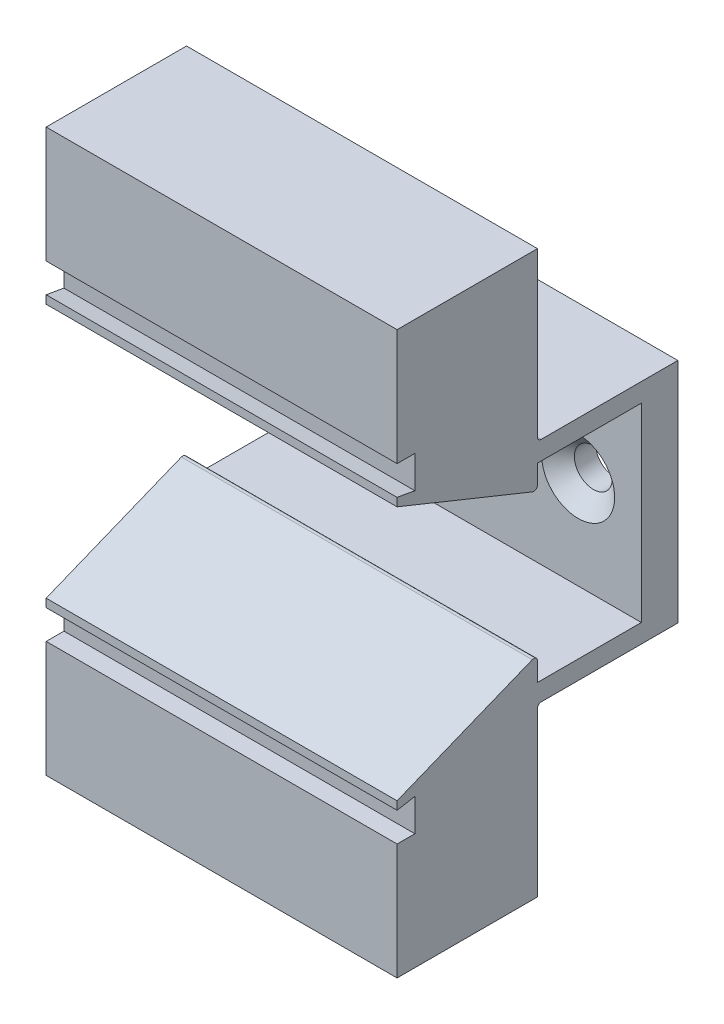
ISO-10303-21;
HEADER;
FILE_DESCRIPTION(('STEP AP214'),'2;1');
FILE_NAME('part.step','',(''),(''),'','','');
FILE_SCHEMA(('AUTOMOTIVE_DESIGN { 1 0 10303 214 1 1 1 1 }'));
ENDSEC;
DATA;
#1=APPLICATION_CONTEXT('core data for automotive mechanical design processes');
#2=APPLICATION_PROTOCOL_DEFINITION('international standard','automotive_design',2000,#1);
#3=PRODUCT_CONTEXT('',#1,'mechanical');
#4=PRODUCT('Part','Part','',(#3));
#5=PRODUCT_RELATED_PRODUCT_CATEGORY('part','',(#4));
#6=PRODUCT_DEFINITION_FORMATION('','',#4);
#7=PRODUCT_DEFINITION_CONTEXT('part definition',#1,'design');
#8=PRODUCT_DEFINITION('design','',#6,#7);
#9=PRODUCT_DEFINITION_SHAPE('','',#8);
#10=(LENGTH_UNIT() NAMED_UNIT(*) SI_UNIT(.MILLI.,.METRE.));
#11=(NAMED_UNIT(*) PLANE_ANGLE_UNIT() SI_UNIT($,.RADIAN.));
#12=(NAMED_UNIT(*) SI_UNIT($,.STERADIAN.) SOLID_ANGLE_UNIT());
#13=UNCERTAINTY_MEASURE_WITH_UNIT(LENGTH_MEASURE(1.E-05),#10,'distance_accuracy_value','');
#14=(GEOMETRIC_REPRESENTATION_CONTEXT(3) GLOBAL_UNCERTAINTY_ASSIGNED_CONTEXT((#13)) GLOBAL_UNIT_ASSIGNED_CONTEXT((#10,
#11,#12)) REPRESENTATION_CONTEXT('',''));
#15=CARTESIAN_POINT('',(0.,0.,0.));
#16=DIRECTION('',(0.,0.,1.));
#17=DIRECTION('',(1.,0.,0.));
#18=AXIS2_PLACEMENT_3D('',#15,#16,#17);
#19=CARTESIAN_POINT('',(23.8125,15.4305,0.));
#20=DIRECTION('',(0.,-1.,0.));
#21=DIRECTION('',(0.,0.,-1.));
#22=AXIS2_PLACEMENT_3D('',#19,#20,#21);
#23=PLANE('',#22);
#24=DIRECTION('',(0.,0.,1.));
#25=VECTOR('',#24,1.);
#26=CARTESIAN_POINT('',(-23.8125,15.4305,0.));
#27=LINE('',#26,#25);
#28=CARTESIAN_POINT('',(-23.8125,15.4305,0.));
#29=VERTEX_POINT('',#28);
#30=CARTESIAN_POINT('',(-23.8125,15.4305,18.542));
#31=VERTEX_POINT('',#30);
#32=EDGE_CURVE('E204',#29,#31,#27,.T.);
#33=ORIENTED_EDGE('',*,*,#32,.T.);
#34=DIRECTION('',(-1.,0.,0.));
#35=VECTOR('',#34,1.);
#36=CARTESIAN_POINT('',(23.8125,15.4305,18.542));
#37=LINE('',#36,#35);
#38=CARTESIAN_POINT('',(23.8125,15.4305,18.542));
#39=VERTEX_POINT('',#38);
#40=EDGE_CURVE('E9',#39,#31,#37,.T.);
#41=ORIENTED_EDGE('',*,*,#40,.F.);
#42=DIRECTION('',(0.,0.,1.));
#43=VECTOR('',#42,1.);
#44=CARTESIAN_POINT('',(23.8125,15.4305,0.));
#45=LINE('',#44,#43);
#46=CARTESIAN_POINT('',(23.8125,15.4305,0.));
#47=VERTEX_POINT('',#46);
#48=EDGE_CURVE('E276',#47,#39,#45,.T.);
#49=ORIENTED_EDGE('',*,*,#48,.F.);
#50=DIRECTION('',(-1.,0.,0.));
#51=VECTOR('',#50,1.);
#52=CARTESIAN_POINT('',(23.8125,15.4305,0.));
#53=LINE('',#52,#51);
#54=EDGE_CURVE('E217',#47,#29,#53,.T.);
#55=ORIENTED_EDGE('',*,*,#54,.T.);
#56=EDGE_LOOP('',(#33,#41,#49,#55));
#57=FACE_BOUND('',#56,.T.);
#58=ADVANCED_FACE('F14',(#57),#23,.F.);
#59=CARTESIAN_POINT('',(23.8125,15.9385,18.542));
#60=DIRECTION('',(-1.,0.,0.));
#61=DIRECTION('',(0.,-1.,0.));
#62=AXIS2_PLACEMENT_3D('',#59,#60,#61);
#63=CYLINDRICAL_SURFACE('',#62,0.508);
#64=CARTESIAN_POINT('',(-23.8125,15.9385,18.542));
#65=DIRECTION('',(-1.,0.,0.));
#66=DIRECTION('',(0.,-1.,0.));
#67=AXIS2_PLACEMENT_3D('',#64,#65,#66);
#68=CIRCLE('',#67,0.508);
#69=CARTESIAN_POINT('',(-23.8125,15.9385,19.05));
#70=VERTEX_POINT('',#69);
#71=EDGE_CURVE('E200',#31,#70,#68,.T.);
#72=ORIENTED_EDGE('',*,*,#71,.T.);
#73=DIRECTION('',(-1.,0.,0.));
#74=VECTOR('',#73,1.);
#75=CARTESIAN_POINT('',(23.8125,15.9385,19.05));
#76=LINE('',#75,#74);
#77=CARTESIAN_POINT('',(23.8125,15.9385,19.05));
#78=VERTEX_POINT('',#77);
#79=EDGE_CURVE('E22',#78,#70,#76,.T.);
#80=ORIENTED_EDGE('',*,*,#79,.F.);
#81=CARTESIAN_POINT('',(23.8125,15.9385,18.542));
#82=DIRECTION('',(-1.,0.,0.));
#83=DIRECTION('',(0.,-1.,0.));
#84=AXIS2_PLACEMENT_3D('',#81,#82,#83);
#85=CIRCLE('',#84,0.508);
#86=EDGE_CURVE('E213',#39,#78,#85,.T.);
#87=ORIENTED_EDGE('',*,*,#86,.F.);
#88=ORIENTED_EDGE('',*,*,#40,.T.);
#89=EDGE_LOOP('',(#72,#80,#87,#88));
#90=FACE_BOUND('',#89,.T.);
#91=ADVANCED_FACE('F212',(#90),#63,.F.);
#92=CARTESIAN_POINT('',(23.8125,15.9385,19.05));
#93=DIRECTION('',(0.,0.,1.));
#94=DIRECTION('',(1.,0.,0.));
#95=AXIS2_PLACEMENT_3D('',#92,#93,#94);
#96=PLANE('',#95);
#97=DIRECTION('',(0.,1.,0.));
#98=VECTOR('',#97,1.);
#99=CARTESIAN_POINT('',(-23.8125,15.9385,19.05));
#100=LINE('',#99,#98);
#101=CARTESIAN_POINT('',(-23.8125,38.1,19.05));
#102=VERTEX_POINT('',#101);
#103=EDGE_CURVE('E206',#70,#102,#100,.T.);
#104=ORIENTED_EDGE('',*,*,#103,.T.);
#105=DIRECTION('',(-1.,0.,0.));
#106=VECTOR('',#105,1.);
#107=CARTESIAN_POINT('',(23.8125,38.1,19.05));
#108=LINE('',#107,#106);
#109=CARTESIAN_POINT('',(23.8125,38.1,19.05));
#110=VERTEX_POINT('',#109);
#111=EDGE_CURVE('E402',#110,#102,#108,.T.);
#112=ORIENTED_EDGE('',*,*,#111,.F.);
#113=DIRECTION('',(0.,1.,0.));
#114=VECTOR('',#113,1.);
#115=CARTESIAN_POINT('',(23.8125,15.9385,19.05));
#116=LINE('',#115,#114);
#117=EDGE_CURVE('E279',#78,#110,#116,.T.);
#118=ORIENTED_EDGE('',*,*,#117,.F.);
#119=ORIENTED_EDGE('',*,*,#79,.T.);
#120=EDGE_LOOP('',(#104,#112,#118,#119));
#121=FACE_BOUND('',#120,.T.);
#122=ADVANCED_FACE('F569',(#121),#96,.F.);
#123=CARTESIAN_POINT('',(23.8125,38.1,19.05));
#124=DIRECTION('',(0.,-1.,0.));
#125=DIRECTION('',(1.,0.,0.));
#126=AXIS2_PLACEMENT_3D('',#123,#124,#125);
#127=PLANE('',#126);
#128=DIRECTION('',(0.,0.,1.));
#129=VECTOR('',#128,1.);
#130=CARTESIAN_POINT('',(-23.8125,38.1,19.05));
#131=LINE('',#130,#129);
#132=CARTESIAN_POINT('',(-23.8125,38.1,38.1));
#133=VERTEX_POINT('',#132);
#134=EDGE_CURVE('E226',#102,#133,#131,.T.);
#135=ORIENTED_EDGE('',*,*,#134,.T.);
#136=DIRECTION('',(-1.,0.,0.));
#137=VECTOR('',#136,1.);
#138=CARTESIAN_POINT('',(23.8125,38.1,38.1));
#139=LINE('',#138,#137);
#140=CARTESIAN_POINT('',(23.8125,38.1,38.1));
#141=VERTEX_POINT('',#140);
#142=EDGE_CURVE('E399',#141,#133,#139,.T.);
#143=ORIENTED_EDGE('',*,*,#142,.F.);
#144=DIRECTION('',(0.,0.,1.));
#145=VECTOR('',#144,1.);
#146=CARTESIAN_POINT('',(23.8125,38.1,19.05));
#147=LINE('',#146,#145);
#148=EDGE_CURVE('E281',#110,#141,#147,.T.);
#149=ORIENTED_EDGE('',*,*,#148,.F.);
#150=ORIENTED_EDGE('',*,*,#111,.T.);
#151=EDGE_LOOP('',(#135,#143,#149,#150));
#152=FACE_BOUND('',#151,.T.);
#153=ADVANCED_FACE('F565',(#152),#127,.F.);
#154=CARTESIAN_POINT('',(23.8125,38.1,38.1));
#155=DIRECTION('',(0.,0.,-1.));
#156=DIRECTION('',(0.,1.,0.));
#157=AXIS2_PLACEMENT_3D('',#154,#155,#156);
#158=PLANE('',#157);
#159=DIRECTION('',(0.,-1.,0.));
#160=VECTOR('',#159,1.);
#161=CARTESIAN_POINT('',(-23.8125,38.1,38.1));
#162=LINE('',#161,#160);
#163=CARTESIAN_POINT('',(-23.8125,22.352,38.1));
#164=VERTEX_POINT('',#163);
#165=EDGE_CURVE('E228',#133,#164,#162,.T.);
#166=ORIENTED_EDGE('',*,*,#165,.T.);
#167=DIRECTION('',(-1.,0.,0.));
#168=VECTOR('',#167,1.);
#169=CARTESIAN_POINT('',(23.8125,22.352,38.1));
#170=LINE('',#169,#168);
#171=CARTESIAN_POINT('',(23.8125,22.352,38.1));
#172=VERTEX_POINT('',#171);
#173=EDGE_CURVE('E396',#172,#164,#170,.T.);
#174=ORIENTED_EDGE('',*,*,#173,.F.);
#175=DIRECTION('',(0.,-1.,0.));
#176=VECTOR('',#175,1.);
#177=CARTESIAN_POINT('',(23.8125,38.1,38.1));
#178=LINE('',#177,#176);
#179=EDGE_CURVE('E283',#141,#172,#178,.T.);
#180=ORIENTED_EDGE('',*,*,#179,.F.);
#181=ORIENTED_EDGE('',*,*,#142,.T.);
#182=EDGE_LOOP('',(#166,#174,#180,#181));
#183=FACE_BOUND('',#182,.T.);
#184=ADVANCED_FACE('F561',(#183),#158,.F.);
#185=CARTESIAN_POINT('',(23.8125,22.352,38.1));
#186=DIRECTION('',(0.,1.,0.));
#187=DIRECTION('',(0.,0.,1.));
#188=AXIS2_PLACEMENT_3D('',#185,#186,#187);
#189=PLANE('',#188);
#190=DIRECTION('',(0.,0.,-1.));
#191=VECTOR('',#190,1.);
#192=CARTESIAN_POINT('',(-23.8125,22.352,38.1));
#193=LINE('',#192,#191);
#194=CARTESIAN_POINT('',(-23.8125,22.352,35.687));
#195=VERTEX_POINT('',#194);
#196=EDGE_CURVE('E230',#164,#195,#193,.T.);
#197=ORIENTED_EDGE('',*,*,#196,.T.);
#198=DIRECTION('',(-1.,0.,0.));
#199=VECTOR('',#198,1.);
#200=CARTESIAN_POINT('',(23.8125,22.352,35.687));
#201=LINE('',#200,#199);
#202=CARTESIAN_POINT('',(23.8125,22.352,35.687));
#203=VERTEX_POINT('',#202);
#204=EDGE_CURVE('E393',#203,#195,#201,.T.);
#205=ORIENTED_EDGE('',*,*,#204,.F.);
#206=DIRECTION('',(0.,0.,-1.));
#207=VECTOR('',#206,1.);
#208=CARTESIAN_POINT('',(23.8125,22.352,38.1));
#209=LINE('',#208,#207);
#210=EDGE_CURVE('E285',#172,#203,#209,.T.);
#211=ORIENTED_EDGE('',*,*,#210,.F.);
#212=ORIENTED_EDGE('',*,*,#173,.T.);
#213=EDGE_LOOP('',(#197,#205,#211,#212));
#214=FACE_BOUND('',#213,.T.);
#215=ADVANCED_FACE('F556',(#214),#189,.F.);
#216=CARTESIAN_POINT('',(23.8125,22.352,35.687));
#217=DIRECTION('',(0.,0.,-1.));
#218=DIRECTION('',(0.,1.,0.));
#219=AXIS2_PLACEMENT_3D('',#216,#217,#218);
#220=PLANE('',#219);
#221=DIRECTION('',(0.,-1.,0.));
#222=VECTOR('',#221,1.);
#223=CARTESIAN_POINT('',(-23.8125,22.352,35.687));
#224=LINE('',#223,#222);
#225=CARTESIAN_POINT('',(-23.8125,17.9641229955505,35.687));
#226=VERTEX_POINT('',#225);
#227=EDGE_CURVE('E232',#195,#226,#224,.T.);
#228=ORIENTED_EDGE('',*,*,#227,.T.);
#229=DIRECTION('',(-1.,0.,0.));
#230=VECTOR('',#229,1.);
#231=CARTESIAN_POINT('',(23.8125,17.9641229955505,35.687));
#232=LINE('',#231,#230);
#233=CARTESIAN_POINT('',(23.8125,17.9641229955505,35.687));
#234=VERTEX_POINT('',#233);
#235=EDGE_CURVE('E390',#234,#226,#232,.T.);
#236=ORIENTED_EDGE('',*,*,#235,.F.);
#237=DIRECTION('',(0.,-1.,0.));
#238=VECTOR('',#237,1.);
#239=CARTESIAN_POINT('',(23.8125,22.352,35.687));
#240=LINE('',#239,#238);
#241=EDGE_CURVE('E287',#203,#234,#240,.T.);
#242=ORIENTED_EDGE('',*,*,#241,.F.);
#243=ORIENTED_EDGE('',*,*,#204,.T.);
#244=EDGE_LOOP('',(#228,#236,#242,#243));
#245=FACE_BOUND('',#244,.T.);
#246=ADVANCED_FACE('F551',(#245),#220,.F.);
#247=CARTESIAN_POINT('',(23.8125,17.9641229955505,35.687));
#248=DIRECTION('',(0.,-0.984807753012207,0.173648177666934));
#249=DIRECTION('',(0.,-0.173648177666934,-0.984807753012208));
#250=AXIS2_PLACEMENT_3D('',#247,#248,#249);
#251=PLANE('',#250);
#252=DIRECTION('',(0.,0.173648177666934,0.984807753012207));
#253=VECTOR('',#252,1.);
#254=CARTESIAN_POINT('',(-23.8125,17.9641229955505,35.687));
#255=LINE('',#254,#253);
#256=CARTESIAN_POINT('',(-23.8125,18.3896,38.1));
#257=VERTEX_POINT('',#256);
#258=EDGE_CURVE('E234',#226,#257,#255,.T.);
#259=ORIENTED_EDGE('',*,*,#258,.T.);
#260=DIRECTION('',(-1.,0.,0.));
#261=VECTOR('',#260,1.);
#262=CARTESIAN_POINT('',(23.8125,18.3896,38.1));
#263=LINE('',#262,#261);
#264=CARTESIAN_POINT('',(23.8125,18.3896,38.1));
#265=VERTEX_POINT('',#264);
#266=EDGE_CURVE('E387',#265,#257,#263,.T.);
#267=ORIENTED_EDGE('',*,*,#266,.F.);
#268=DIRECTION('',(0.,0.173648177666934,0.984807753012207));
#269=VECTOR('',#268,1.);
#270=CARTESIAN_POINT('',(23.8125,17.9641229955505,35.687));
#271=LINE('',#270,#269);
#272=EDGE_CURVE('E289',#234,#265,#271,.T.);
#273=ORIENTED_EDGE('',*,*,#272,.F.);
#274=ORIENTED_EDGE('',*,*,#235,.T.);
#275=EDGE_LOOP('',(#259,#267,#273,#274));
#276=FACE_BOUND('',#275,.T.);
#277=ADVANCED_FACE('F547',(#276),#251,.F.);
#278=CARTESIAN_POINT('',(23.8125,18.3896,38.1));
#279=DIRECTION('',(0.,0.,-1.));
#280=DIRECTION('',(0.,1.,0.));
#281=AXIS2_PLACEMENT_3D('',#278,#279,#280);
#282=PLANE('',#281);
#283=DIRECTION('',(0.,-1.,0.));
#284=VECTOR('',#283,1.);
#285=CARTESIAN_POINT('',(-23.8125,18.3896,38.1));
#286=LINE('',#285,#284);
#287=CARTESIAN_POINT('',(-23.8125,17.272,38.1));
#288=VERTEX_POINT('',#287);
#289=EDGE_CURVE('E236',#257,#288,#286,.T.);
#290=ORIENTED_EDGE('',*,*,#289,.T.);
#291=DIRECTION('',(-1.,0.,0.));
#292=VECTOR('',#291,1.);
#293=CARTESIAN_POINT('',(23.8125,17.272,38.1));
#294=LINE('',#293,#292);
#295=CARTESIAN_POINT('',(23.8125,17.272,38.1));
#296=VERTEX_POINT('',#295);
#297=EDGE_CURVE('E384',#296,#288,#294,.T.);
#298=ORIENTED_EDGE('',*,*,#297,.F.);
#299=DIRECTION('',(0.,-1.,0.));
#300=VECTOR('',#299,1.);
#301=CARTESIAN_POINT('',(23.8125,18.3896,38.1));
#302=LINE('',#301,#300);
#303=EDGE_CURVE('E291',#265,#296,#302,.T.);
#304=ORIENTED_EDGE('',*,*,#303,.F.);
#305=ORIENTED_EDGE('',*,*,#266,.T.);
#306=EDGE_LOOP('',(#290,#298,#304,#305));
#307=FACE_BOUND('',#306,.T.);
#308=ADVANCED_FACE('F542',(#307),#282,.F.);
#309=CARTESIAN_POINT('',(23.8125,17.272,38.1));
#310=DIRECTION('',(0.,0.927183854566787,-0.374606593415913));
#311=DIRECTION('',(0.,0.374606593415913,0.927183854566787));
#312=AXIS2_PLACEMENT_3D('',#309,#310,#311);
#313=PLANE('',#312);
#314=DIRECTION('',(0.,-0.374606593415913,-0.927183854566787));
#315=VECTOR('',#314,1.);
#316=CARTESIAN_POINT('',(-23.8125,17.272,38.1));
#317=LINE('',#316,#315);
#318=CARTESIAN_POINT('',(-23.8125,9.85743197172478,19.7483001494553));
#319=VERTEX_POINT('',#318);
#320=EDGE_CURVE('E238',#288,#319,#317,.T.);
#321=ORIENTED_EDGE('',*,*,#320,.T.);
#322=DIRECTION('',(-1.,0.,0.));
#323=VECTOR('',#322,1.);
#324=CARTESIAN_POINT('',(23.8125,9.85743197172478,19.7483001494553));
#325=LINE('',#324,#323);
#326=CARTESIAN_POINT('',(23.8125,9.85743197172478,19.7483001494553));
#327=VERTEX_POINT('',#326);
#328=EDGE_CURVE('E381',#327,#319,#325,.T.);
#329=ORIENTED_EDGE('',*,*,#328,.F.);
#330=DIRECTION('',(0.,-0.374606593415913,-0.927183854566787));
#331=VECTOR('',#330,1.);
#332=CARTESIAN_POINT('',(23.8125,17.272,38.1));
#333=LINE('',#332,#331);
#334=EDGE_CURVE('E293',#296,#327,#333,.T.);
#335=ORIENTED_EDGE('',*,*,#334,.F.);
#336=ORIENTED_EDGE('',*,*,#297,.T.);
#337=EDGE_LOOP('',(#321,#329,#335,#336));
#338=FACE_BOUND('',#337,.T.);
#339=ADVANCED_FACE('F536',(#338),#313,.F.);
#340=CARTESIAN_POINT('',(23.8125,10.3284413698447,19.558));
#341=DIRECTION('',(-1.,0.,0.));
#342=DIRECTION('',(0.,-1.,0.));
#343=AXIS2_PLACEMENT_3D('',#340,#341,#342);
#344=CYLINDRICAL_SURFACE('',#343,0.508);
#345=CARTESIAN_POINT('',(-23.8125,10.3284413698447,19.558));
#346=DIRECTION('',(1.,0.,0.));
#347=DIRECTION('',(0.,1.,0.));
#348=AXIS2_PLACEMENT_3D('',#345,#346,#347);
#349=CIRCLE('',#348,0.508);
#350=CARTESIAN_POINT('',(-23.8125,10.3284413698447,19.05));
#351=VERTEX_POINT('',#350);
#352=EDGE_CURVE('E240',#319,#351,#349,.T.);
#353=ORIENTED_EDGE('',*,*,#352,.T.);
#354=DIRECTION('',(-1.,0.,0.));
#355=VECTOR('',#354,1.);
#356=CARTESIAN_POINT('',(23.8125,10.3284413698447,19.05));
#357=LINE('',#356,#355);
#358=CARTESIAN_POINT('',(23.8125,10.3284413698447,19.05));
#359=VERTEX_POINT('',#358);
#360=EDGE_CURVE('E378',#359,#351,#357,.T.);
#361=ORIENTED_EDGE('',*,*,#360,.F.);
#362=CARTESIAN_POINT('',(23.8125,10.3284413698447,19.558));
#363=DIRECTION('',(1.,0.,0.));
#364=DIRECTION('',(0.,1.,0.));
#365=AXIS2_PLACEMENT_3D('',#362,#363,#364);
#366=CIRCLE('',#365,0.508);
#367=EDGE_CURVE('E295',#327,#359,#366,.T.);
#368=ORIENTED_EDGE('',*,*,#367,.F.);
#369=ORIENTED_EDGE('',*,*,#328,.T.);
#370=EDGE_LOOP('',(#353,#361,#368,#369));
#371=FACE_BOUND('',#370,.T.);
#372=ADVANCED_FACE('F532',(#371),#344,.T.);
#373=CARTESIAN_POINT('',(23.8125,10.3284413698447,19.05));
#374=DIRECTION('',(0.,0.,1.));
#375=DIRECTION('',(1.,0.,0.));
#376=AXIS2_PLACEMENT_3D('',#373,#374,#375);
#377=PLANE('',#376);
#378=DIRECTION('',(0.,1.,0.));
#379=VECTOR('',#378,1.);
#380=CARTESIAN_POINT('',(-23.8125,10.3284413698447,19.05));
#381=LINE('',#380,#379);
#382=CARTESIAN_POINT('',(-23.8125,12.8905,19.05));
#383=VERTEX_POINT('',#382);
#384=EDGE_CURVE('E242',#351,#383,#381,.T.);
#385=ORIENTED_EDGE('',*,*,#384,.T.);
#386=DIRECTION('',(-1.,0.,0.));
#387=VECTOR('',#386,1.);
#388=CARTESIAN_POINT('',(23.8125,12.8905,19.05));
#389=LINE('',#388,#387);
#390=CARTESIAN_POINT('',(23.8125,12.8905,19.05));
#391=VERTEX_POINT('',#390);
#392=EDGE_CURVE('E375',#391,#383,#389,.T.);
#393=ORIENTED_EDGE('',*,*,#392,.F.);
#394=DIRECTION('',(0.,1.,0.));
#395=VECTOR('',#394,1.);
#396=CARTESIAN_POINT('',(23.8125,10.3284413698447,19.05));
#397=LINE('',#396,#395);
#398=EDGE_CURVE('E297',#359,#391,#397,.T.);
#399=ORIENTED_EDGE('',*,*,#398,.F.);
#400=ORIENTED_EDGE('',*,*,#360,.T.);
#401=EDGE_LOOP('',(#385,#393,#399,#400));
#402=FACE_BOUND('',#401,.T.);
#403=ADVANCED_FACE('F527',(#402),#377,.F.);
#404=CARTESIAN_POINT('',(23.8125,12.8905,19.05));
#405=DIRECTION('',(0.,1.,0.));
#406=DIRECTION('',(-1.,0.,0.));
#407=AXIS2_PLACEMENT_3D('',#404,#405,#406);
#408=PLANE('',#407);
#409=DIRECTION('',(0.,0.,-1.));
#410=VECTOR('',#409,1.);
#411=CARTESIAN_POINT('',(-23.8125,12.8905,19.05));
#412=LINE('',#411,#410);
#413=CARTESIAN_POINT('',(-23.8125,12.8905,4.953));
#414=VERTEX_POINT('',#413);
#415=EDGE_CURVE('E244',#383,#414,#412,.T.);
#416=ORIENTED_EDGE('',*,*,#415,.T.);
#417=DIRECTION('',(-1.,0.,0.));
#418=VECTOR('',#417,1.);
#419=CARTESIAN_POINT('',(23.8125,12.8905,4.953));
#420=LINE('',#419,#418);
#421=CARTESIAN_POINT('',(23.8125,12.8905,4.953));
#422=VERTEX_POINT('',#421);
#423=EDGE_CURVE('E372',#422,#414,#420,.T.);
#424=ORIENTED_EDGE('',*,*,#423,.F.);
#425=DIRECTION('',(0.,0.,-1.));
#426=VECTOR('',#425,1.);
#427=CARTESIAN_POINT('',(23.8125,12.8905,19.05));
#428=LINE('',#427,#426);
#429=EDGE_CURVE('E299',#391,#422,#428,.T.);
#430=ORIENTED_EDGE('',*,*,#429,.F.);
#431=ORIENTED_EDGE('',*,*,#392,.T.);
#432=EDGE_LOOP('',(#416,#424,#430,#431));
#433=FACE_BOUND('',#432,.T.);
#434=ADVANCED_FACE('F521',(#433),#408,.F.);
#435=CARTESIAN_POINT('',(23.8125,12.8905,4.953));
#436=DIRECTION('',(0.,0.,-1.));
#437=DIRECTION('',(-1.,0.,0.));
#438=AXIS2_PLACEMENT_3D('',#435,#436,#437);
#439=PLANE('',#438);
#440=CARTESIAN_POINT('',(-15.24,0.,4.953));
#441=DIRECTION('',(0.,0.,-1.));
#442=DIRECTION('',(0.,1.,0.));
#443=AXIS2_PLACEMENT_3D('',#440,#441,#442);
#444=CIRCLE('',#443,4.953);
#445=CARTESIAN_POINT('',(-15.24,4.953,4.953));
#446=VERTEX_POINT('',#445);
#447=EDGE_CURVE('E422',#446,#446,#444,.T.);
#448=ORIENTED_EDGE('',*,*,#447,.T.);
#449=EDGE_LOOP('',(#448));
#450=FACE_BOUND('',#449,.T.);
#451=CARTESIAN_POINT('',(15.24,0.,4.953));
#452=DIRECTION('',(0.,0.,-1.));
#453=DIRECTION('',(0.,1.,0.));
#454=AXIS2_PLACEMENT_3D('',#451,#452,#453);
#455=CIRCLE('',#454,4.953);
#456=CARTESIAN_POINT('',(15.24,4.953,4.953));
#457=VERTEX_POINT('',#456);
#458=EDGE_CURVE('E412',#457,#457,#455,.T.);
#459=ORIENTED_EDGE('',*,*,#458,.T.);
#460=EDGE_LOOP('',(#459));
#461=FACE_BOUND('',#460,.T.);
#462=CARTESIAN_POINT('',(0.,0.,4.953));
#463=DIRECTION('',(0.,0.,-1.));
#464=DIRECTION('',(-1.,0.,0.));
#465=AXIS2_PLACEMENT_3D('',#462,#463,#464);
#466=CIRCLE('',#465,6.7437);
#467=CARTESIAN_POINT('',(-6.7437,0.,4.953));
#468=VERTEX_POINT('',#467);
#469=EDGE_CURVE('E218',#468,#468,#466,.T.);
#470=ORIENTED_EDGE('',*,*,#469,.T.);
#471=EDGE_LOOP('',(#470));
#472=FACE_BOUND('',#471,.T.);
#473=DIRECTION('',(0.,-1.,0.));
#474=VECTOR('',#473,1.);
#475=CARTESIAN_POINT('',(-23.8125,12.8905,4.953));
#476=LINE('',#475,#474);
#477=CARTESIAN_POINT('',(-23.8125,-12.8905,4.953));
#478=VERTEX_POINT('',#477);
#479=EDGE_CURVE('E246',#414,#478,#476,.T.);
#480=ORIENTED_EDGE('',*,*,#479,.T.);
#481=DIRECTION('',(-1.,0.,0.));
#482=VECTOR('',#481,1.);
#483=CARTESIAN_POINT('',(23.8125,-12.8905,4.953));
#484=LINE('',#483,#482);
#485=CARTESIAN_POINT('',(23.8125,-12.8905,4.953));
#486=VERTEX_POINT('',#485);
#487=EDGE_CURVE('E369',#486,#478,#484,.T.);
#488=ORIENTED_EDGE('',*,*,#487,.F.);
#489=DIRECTION('',(0.,-1.,0.));
#490=VECTOR('',#489,1.);
#491=CARTESIAN_POINT('',(23.8125,12.8905,4.953));
#492=LINE('',#491,#490);
#493=EDGE_CURVE('E301',#422,#486,#492,.T.);
#494=ORIENTED_EDGE('',*,*,#493,.F.);
#495=ORIENTED_EDGE('',*,*,#423,.T.);
#496=EDGE_LOOP('',(#480,#488,#494,#495));
#497=FACE_BOUND('',#496,.T.);
#498=ADVANCED_FACE('F426',(#450,#461,#472,#497),#439,.F.);
#499=CARTESIAN_POINT('',(23.8125,-12.8905,19.05));
#500=DIRECTION('',(0.,-1.,0.));
#501=DIRECTION('',(0.,0.,-1.));
#502=AXIS2_PLACEMENT_3D('',#499,#500,#501);
#503=PLANE('',#502);
#504=DIRECTION('',(0.,0.,1.));
#505=VECTOR('',#504,1.);
#506=CARTESIAN_POINT('',(-23.8125,-12.8905,19.05));
#507=LINE('',#506,#505);
#508=CARTESIAN_POINT('',(-23.8125,-12.8905,19.05));
#509=VERTEX_POINT('',#508);
#510=EDGE_CURVE('E248',#478,#509,#507,.T.);
#511=ORIENTED_EDGE('',*,*,#510,.T.);
#512=DIRECTION('',(-1.,0.,0.));
#513=VECTOR('',#512,1.);
#514=CARTESIAN_POINT('',(23.8125,-12.8905,19.05));
#515=LINE('',#514,#513);
#516=CARTESIAN_POINT('',(23.8125,-12.8905,19.05));
#517=VERTEX_POINT('',#516);
#518=EDGE_CURVE('E366',#517,#509,#515,.T.);
#519=ORIENTED_EDGE('',*,*,#518,.F.);
#520=DIRECTION('',(0.,0.,1.));
#521=VECTOR('',#520,1.);
#522=CARTESIAN_POINT('',(23.8125,-12.8905,19.05));
#523=LINE('',#522,#521);
#524=EDGE_CURVE('E303',#486,#517,#523,.T.);
#525=ORIENTED_EDGE('',*,*,#524,.F.);
#526=ORIENTED_EDGE('',*,*,#487,.T.);
#527=EDGE_LOOP('',(#511,#519,#525,#526));
#528=FACE_BOUND('',#527,.T.);
#529=ADVANCED_FACE('F513',(#528),#503,.F.);
#530=CARTESIAN_POINT('',(23.8125,-10.3284413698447,19.05));
#531=DIRECTION('',(0.,0.,1.));
#532=DIRECTION('',(1.,0.,0.));
#533=AXIS2_PLACEMENT_3D('',#530,#531,#532);
#534=PLANE('',#533);
#535=DIRECTION('',(0.,1.,0.));
#536=VECTOR('',#535,1.);
#537=CARTESIAN_POINT('',(-23.8125,-10.3284413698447,19.05));
#538=LINE('',#537,#536);
#539=CARTESIAN_POINT('',(-23.8125,-10.3284413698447,19.05));
#540=VERTEX_POINT('',#539);
#541=EDGE_CURVE('E250',#509,#540,#538,.T.);
#542=ORIENTED_EDGE('',*,*,#541,.T.);
#543=DIRECTION('',(-1.,0.,0.));
#544=VECTOR('',#543,1.);
#545=CARTESIAN_POINT('',(23.8125,-10.3284413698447,19.05));
#546=LINE('',#545,#544);
#547=CARTESIAN_POINT('',(23.8125,-10.3284413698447,19.05));
#548=VERTEX_POINT('',#547);
#549=EDGE_CURVE('E363',#548,#540,#546,.T.);
#550=ORIENTED_EDGE('',*,*,#549,.F.);
#551=DIRECTION('',(0.,1.,0.));
#552=VECTOR('',#551,1.);
#553=CARTESIAN_POINT('',(23.8125,-10.3284413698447,19.05));
#554=LINE('',#553,#552);
#555=EDGE_CURVE('E305',#517,#548,#554,.T.);
#556=ORIENTED_EDGE('',*,*,#555,.F.);
#557=ORIENTED_EDGE('',*,*,#518,.T.);
#558=EDGE_LOOP('',(#542,#550,#556,#557));
#559=FACE_BOUND('',#558,.T.);
#560=ADVANCED_FACE('F507',(#559),#534,.F.);
#561=CARTESIAN_POINT('',(23.8125,-10.3284413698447,19.558));
#562=DIRECTION('',(-1.,0.,0.));
#563=DIRECTION('',(0.,-1.,0.));
#564=AXIS2_PLACEMENT_3D('',#561,#562,#563);
#565=CYLINDRICAL_SURFACE('',#564,0.508);
#566=CARTESIAN_POINT('',(-23.8125,-10.3284413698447,19.558));
#567=DIRECTION('',(1.,0.,0.));
#568=DIRECTION('',(0.,-1.,0.));
#569=AXIS2_PLACEMENT_3D('',#566,#567,#568);
#570=CIRCLE('',#569,0.508);
#571=CARTESIAN_POINT('',(-23.8125,-9.8574319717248,19.7483001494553));
#572=VERTEX_POINT('',#571);
#573=EDGE_CURVE('E252',#540,#572,#570,.T.);
#574=ORIENTED_EDGE('',*,*,#573,.T.);
#575=DIRECTION('',(-1.,0.,0.));
#576=VECTOR('',#575,1.);
#577=CARTESIAN_POINT('',(23.8125,-9.8574319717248,19.7483001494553));
#578=LINE('',#577,#576);
#579=CARTESIAN_POINT('',(23.8125,-9.8574319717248,19.7483001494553));
#580=VERTEX_POINT('',#579);
#581=EDGE_CURVE('E360',#580,#572,#578,.T.);
#582=ORIENTED_EDGE('',*,*,#581,.F.);
#583=CARTESIAN_POINT('',(23.8125,-10.3284413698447,19.558));
#584=DIRECTION('',(1.,0.,0.));
#585=DIRECTION('',(0.,-1.,0.));
#586=AXIS2_PLACEMENT_3D('',#583,#584,#585);
#587=CIRCLE('',#586,0.508);
#588=EDGE_CURVE('E307',#548,#580,#587,.T.);
#589=ORIENTED_EDGE('',*,*,#588,.F.);
#590=ORIENTED_EDGE('',*,*,#549,.T.);
#591=EDGE_LOOP('',(#574,#582,#589,#590));
#592=FACE_BOUND('',#591,.T.);
#593=ADVANCED_FACE('F503',(#592),#565,.T.);
#594=CARTESIAN_POINT('',(23.8125,-17.272,38.1));
#595=DIRECTION('',(0.,-0.927183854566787,-0.374606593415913));
#596=DIRECTION('',(0.,0.374606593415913,-0.927183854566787));
#597=AXIS2_PLACEMENT_3D('',#594,#595,#596);
#598=PLANE('',#597);
#599=DIRECTION('',(0.,-0.374606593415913,0.927183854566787));
#600=VECTOR('',#599,1.);
#601=CARTESIAN_POINT('',(-23.8125,-17.272,38.1));
#602=LINE('',#601,#600);
#603=CARTESIAN_POINT('',(-23.8125,-17.272,38.1));
#604=VERTEX_POINT('',#603);
#605=EDGE_CURVE('E254',#572,#604,#602,.T.);
#606=ORIENTED_EDGE('',*,*,#605,.T.);
#607=DIRECTION('',(-1.,0.,0.));
#608=VECTOR('',#607,1.);
#609=CARTESIAN_POINT('',(23.8125,-17.272,38.1));
#610=LINE('',#609,#608);
#611=CARTESIAN_POINT('',(23.8125,-17.272,38.1));
#612=VERTEX_POINT('',#611);
#613=EDGE_CURVE('E357',#612,#604,#610,.T.);
#614=ORIENTED_EDGE('',*,*,#613,.F.);
#615=DIRECTION('',(0.,-0.374606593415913,0.927183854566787));
#616=VECTOR('',#615,1.);
#617=CARTESIAN_POINT('',(23.8125,-17.272,38.1));
#618=LINE('',#617,#616);
#619=EDGE_CURVE('E309',#580,#612,#618,.T.);
#620=ORIENTED_EDGE('',*,*,#619,.F.);
#621=ORIENTED_EDGE('',*,*,#581,.T.);
#622=EDGE_LOOP('',(#606,#614,#620,#621));
#623=FACE_BOUND('',#622,.T.);
#624=ADVANCED_FACE('F498',(#623),#598,.F.);
#625=CARTESIAN_POINT('',(23.8125,-18.3896,38.1));
#626=DIRECTION('',(0.,0.,-1.));
#627=DIRECTION('',(0.,1.,0.));
#628=AXIS2_PLACEMENT_3D('',#625,#626,#627);
#629=PLANE('',#628);
#630=DIRECTION('',(0.,-1.,0.));
#631=VECTOR('',#630,1.);
#632=CARTESIAN_POINT('',(-23.8125,-18.3896,38.1));
#633=LINE('',#632,#631);
#634=CARTESIAN_POINT('',(-23.8125,-18.3896,38.1));
#635=VERTEX_POINT('',#634);
#636=EDGE_CURVE('E256',#604,#635,#633,.T.);
#637=ORIENTED_EDGE('',*,*,#636,.T.);
#638=DIRECTION('',(-1.,0.,0.));
#639=VECTOR('',#638,1.);
#640=CARTESIAN_POINT('',(23.8125,-18.3896,38.1));
#641=LINE('',#640,#639);
#642=CARTESIAN_POINT('',(23.8125,-18.3896,38.1));
#643=VERTEX_POINT('',#642);
#644=EDGE_CURVE('E354',#643,#635,#641,.T.);
#645=ORIENTED_EDGE('',*,*,#644,.F.);
#646=DIRECTION('',(0.,-1.,0.));
#647=VECTOR('',#646,1.);
#648=CARTESIAN_POINT('',(23.8125,-18.3896,38.1));
#649=LINE('',#648,#647);
#650=EDGE_CURVE('E311',#612,#643,#649,.T.);
#651=ORIENTED_EDGE('',*,*,#650,.F.);
#652=ORIENTED_EDGE('',*,*,#613,.T.);
#653=EDGE_LOOP('',(#637,#645,#651,#652));
#654=FACE_BOUND('',#653,.T.);
#655=ADVANCED_FACE('F492',(#654),#629,.F.);
#656=CARTESIAN_POINT('',(23.8125,-17.9641229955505,35.687));
#657=DIRECTION('',(0.,0.984807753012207,0.173648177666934));
#658=DIRECTION('',(0.,-0.173648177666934,0.984807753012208));
#659=AXIS2_PLACEMENT_3D('',#656,#657,#658);
#660=PLANE('',#659);
#661=DIRECTION('',(0.,0.173648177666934,-0.984807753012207));
#662=VECTOR('',#661,1.);
#663=CARTESIAN_POINT('',(-23.8125,-17.9641229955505,35.687));
#664=LINE('',#663,#662);
#665=CARTESIAN_POINT('',(-23.8125,-17.9641229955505,35.687));
#666=VERTEX_POINT('',#665);
#667=EDGE_CURVE('E258',#635,#666,#664,.T.);
#668=ORIENTED_EDGE('',*,*,#667,.T.);
#669=DIRECTION('',(-1.,0.,0.));
#670=VECTOR('',#669,1.);
#671=CARTESIAN_POINT('',(23.8125,-17.9641229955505,35.687));
#672=LINE('',#671,#670);
#673=CARTESIAN_POINT('',(23.8125,-17.9641229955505,35.687));
#674=VERTEX_POINT('',#673);
#675=EDGE_CURVE('E351',#674,#666,#672,.T.);
#676=ORIENTED_EDGE('',*,*,#675,.F.);
#677=DIRECTION('',(0.,0.173648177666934,-0.984807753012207));
#678=VECTOR('',#677,1.);
#679=CARTESIAN_POINT('',(23.8125,-17.9641229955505,35.687));
#680=LINE('',#679,#678);
#681=EDGE_CURVE('E313',#643,#674,#680,.T.);
#682=ORIENTED_EDGE('',*,*,#681,.F.);
#683=ORIENTED_EDGE('',*,*,#644,.T.);
#684=EDGE_LOOP('',(#668,#676,#682,#683));
#685=FACE_BOUND('',#684,.T.);
#686=ADVANCED_FACE('F488',(#685),#660,.F.);
#687=CARTESIAN_POINT('',(23.8125,-22.352,35.687));
#688=DIRECTION('',(0.,0.,-1.));
#689=DIRECTION('',(0.,1.,0.));
#690=AXIS2_PLACEMENT_3D('',#687,#688,#689);
#691=PLANE('',#690);
#692=DIRECTION('',(0.,-1.,0.));
#693=VECTOR('',#692,1.);
#694=CARTESIAN_POINT('',(-23.8125,-22.352,35.687));
#695=LINE('',#694,#693);
#696=CARTESIAN_POINT('',(-23.8125,-22.352,35.687));
#697=VERTEX_POINT('',#696);
#698=EDGE_CURVE('E260',#666,#697,#695,.T.);
#699=ORIENTED_EDGE('',*,*,#698,.T.);
#700=DIRECTION('',(-1.,0.,0.));
#701=VECTOR('',#700,1.);
#702=CARTESIAN_POINT('',(23.8125,-22.352,35.687));
#703=LINE('',#702,#701);
#704=CARTESIAN_POINT('',(23.8125,-22.352,35.687));
#705=VERTEX_POINT('',#704);
#706=EDGE_CURVE('E348',#705,#697,#703,.T.);
#707=ORIENTED_EDGE('',*,*,#706,.F.);
#708=DIRECTION('',(0.,-1.,0.));
#709=VECTOR('',#708,1.);
#710=CARTESIAN_POINT('',(23.8125,-22.352,35.687));
#711=LINE('',#710,#709);
#712=EDGE_CURVE('E315',#674,#705,#711,.T.);
#713=ORIENTED_EDGE('',*,*,#712,.F.);
#714=ORIENTED_EDGE('',*,*,#675,.T.);
#715=EDGE_LOOP('',(#699,#707,#713,#714));
#716=FACE_BOUND('',#715,.T.);
#717=ADVANCED_FACE('F483',(#716),#691,.F.);
#718=CARTESIAN_POINT('',(23.8125,-22.352,38.1));
#719=DIRECTION('',(0.,-1.,0.));
#720=DIRECTION('',(0.,0.,-1.));
#721=AXIS2_PLACEMENT_3D('',#718,#719,#720);
#722=PLANE('',#721);
#723=DIRECTION('',(0.,0.,1.));
#724=VECTOR('',#723,1.);
#725=CARTESIAN_POINT('',(-23.8125,-22.352,38.1));
#726=LINE('',#725,#724);
#727=CARTESIAN_POINT('',(-23.8125,-22.352,38.1));
#728=VERTEX_POINT('',#727);
#729=EDGE_CURVE('E262',#697,#728,#726,.T.);
#730=ORIENTED_EDGE('',*,*,#729,.T.);
#731=DIRECTION('',(-1.,0.,0.));
#732=VECTOR('',#731,1.);
#733=CARTESIAN_POINT('',(23.8125,-22.352,38.1));
#734=LINE('',#733,#732);
#735=CARTESIAN_POINT('',(23.8125,-22.352,38.1));
#736=VERTEX_POINT('',#735);
#737=EDGE_CURVE('E345',#736,#728,#734,.T.);
#738=ORIENTED_EDGE('',*,*,#737,.F.);
#739=DIRECTION('',(0.,0.,1.));
#740=VECTOR('',#739,1.);
#741=CARTESIAN_POINT('',(23.8125,-22.352,38.1));
#742=LINE('',#741,#740);
#743=EDGE_CURVE('E317',#705,#736,#742,.T.);
#744=ORIENTED_EDGE('',*,*,#743,.F.);
#745=ORIENTED_EDGE('',*,*,#706,.T.);
#746=EDGE_LOOP('',(#730,#738,#744,#745));
#747=FACE_BOUND('',#746,.T.);
#748=ADVANCED_FACE('F477',(#747),#722,.F.);
#749=CARTESIAN_POINT('',(23.8125,-38.1,38.1));
#750=DIRECTION('',(0.,0.,-1.));
#751=DIRECTION('',(0.,1.,0.));
#752=AXIS2_PLACEMENT_3D('',#749,#750,#751);
#753=PLANE('',#752);
#754=DIRECTION('',(0.,-1.,0.));
#755=VECTOR('',#754,1.);
#756=CARTESIAN_POINT('',(-23.8125,-38.1,38.1));
#757=LINE('',#756,#755);
#758=CARTESIAN_POINT('',(-23.8125,-38.1,38.1));
#759=VERTEX_POINT('',#758);
#760=EDGE_CURVE('E264',#728,#759,#757,.T.);
#761=ORIENTED_EDGE('',*,*,#760,.T.);
#762=DIRECTION('',(-1.,0.,0.));
#763=VECTOR('',#762,1.);
#764=CARTESIAN_POINT('',(23.8125,-38.1,38.1));
#765=LINE('',#764,#763);
#766=CARTESIAN_POINT('',(23.8125,-38.1,38.1));
#767=VERTEX_POINT('',#766);
#768=EDGE_CURVE('E342',#767,#759,#765,.T.);
#769=ORIENTED_EDGE('',*,*,#768,.F.);
#770=DIRECTION('',(0.,-1.,0.));
#771=VECTOR('',#770,1.);
#772=CARTESIAN_POINT('',(23.8125,-38.1,38.1));
#773=LINE('',#772,#771);
#774=EDGE_CURVE('E319',#736,#767,#773,.T.);
#775=ORIENTED_EDGE('',*,*,#774,.F.);
#776=ORIENTED_EDGE('',*,*,#737,.T.);
#777=EDGE_LOOP('',(#761,#769,#775,#776));
#778=FACE_BOUND('',#777,.T.);
#779=ADVANCED_FACE('F473',(#778),#753,.F.);
#780=CARTESIAN_POINT('',(23.8125,-38.1,19.05));
#781=DIRECTION('',(0.,1.,0.));
#782=DIRECTION('',(-1.,0.,0.));
#783=AXIS2_PLACEMENT_3D('',#780,#781,#782);
#784=PLANE('',#783);
#785=DIRECTION('',(0.,0.,-1.));
#786=VECTOR('',#785,1.);
#787=CARTESIAN_POINT('',(-23.8125,-38.1,19.05));
#788=LINE('',#787,#786);
#789=CARTESIAN_POINT('',(-23.8125,-38.1,19.05));
#790=VERTEX_POINT('',#789);
#791=EDGE_CURVE('E266',#759,#790,#788,.T.);
#792=ORIENTED_EDGE('',*,*,#791,.T.);
#793=DIRECTION('',(-1.,0.,0.));
#794=VECTOR('',#793,1.);
#795=CARTESIAN_POINT('',(23.8125,-38.1,19.05));
#796=LINE('',#795,#794);
#797=CARTESIAN_POINT('',(23.8125,-38.1,19.05));
#798=VERTEX_POINT('',#797);
#799=EDGE_CURVE('E339',#798,#790,#796,.T.);
#800=ORIENTED_EDGE('',*,*,#799,.F.);
#801=DIRECTION('',(0.,0.,-1.));
#802=VECTOR('',#801,1.);
#803=CARTESIAN_POINT('',(23.8125,-38.1,19.05));
#804=LINE('',#803,#802);
#805=EDGE_CURVE('E321',#767,#798,#804,.T.);
#806=ORIENTED_EDGE('',*,*,#805,.F.);
#807=ORIENTED_EDGE('',*,*,#768,.T.);
#808=EDGE_LOOP('',(#792,#800,#806,#807));
#809=FACE_BOUND('',#808,.T.);
#810=ADVANCED_FACE('F468',(#809),#784,.F.);
#811=CARTESIAN_POINT('',(23.8125,-15.9385,19.05));
#812=DIRECTION('',(0.,0.,1.));
#813=DIRECTION('',(0.,-1.,0.));
#814=AXIS2_PLACEMENT_3D('',#811,#812,#813);
#815=PLANE('',#814);
#816=DIRECTION('',(0.,1.,0.));
#817=VECTOR('',#816,1.);
#818=CARTESIAN_POINT('',(-23.8125,-15.9385,19.05));
#819=LINE('',#818,#817);
#820=CARTESIAN_POINT('',(-23.8125,-15.9385,19.05));
#821=VERTEX_POINT('',#820);
#822=EDGE_CURVE('E268',#790,#821,#819,.T.);
#823=ORIENTED_EDGE('',*,*,#822,.T.);
#824=DIRECTION('',(-1.,0.,0.));
#825=VECTOR('',#824,1.);
#826=CARTESIAN_POINT('',(23.8125,-15.9385,19.05));
#827=LINE('',#826,#825);
#828=CARTESIAN_POINT('',(23.8125,-15.9385,19.05));
#829=VERTEX_POINT('',#828);
#830=EDGE_CURVE('E336',#829,#821,#827,.T.);
#831=ORIENTED_EDGE('',*,*,#830,.F.);
#832=DIRECTION('',(0.,1.,0.));
#833=VECTOR('',#832,1.);
#834=CARTESIAN_POINT('',(23.8125,-15.9385,19.05));
#835=LINE('',#834,#833);
#836=EDGE_CURVE('E323',#798,#829,#835,.T.);
#837=ORIENTED_EDGE('',*,*,#836,.F.);
#838=ORIENTED_EDGE('',*,*,#799,.T.);
#839=EDGE_LOOP('',(#823,#831,#837,#838));
#840=FACE_BOUND('',#839,.T.);
#841=ADVANCED_FACE('F462',(#840),#815,.F.);
#842=CARTESIAN_POINT('',(23.8125,-15.9385,18.542));
#843=DIRECTION('',(-1.,0.,0.));
#844=DIRECTION('',(0.,-1.,0.));
#845=AXIS2_PLACEMENT_3D('',#842,#843,#844);
#846=CYLINDRICAL_SURFACE('',#845,0.508);
#847=CARTESIAN_POINT('',(-23.8125,-15.9385,18.542));
#848=DIRECTION('',(-1.,0.,0.));
#849=DIRECTION('',(0.,-1.,0.));
#850=AXIS2_PLACEMENT_3D('',#847,#848,#849);
#851=CIRCLE('',#850,0.508);
#852=CARTESIAN_POINT('',(-23.8125,-15.4305,18.542));
#853=VERTEX_POINT('',#852);
#854=EDGE_CURVE('E270',#821,#853,#851,.T.);
#855=ORIENTED_EDGE('',*,*,#854,.T.);
#856=DIRECTION('',(-1.,0.,0.));
#857=VECTOR('',#856,1.);
#858=CARTESIAN_POINT('',(23.8125,-15.4305,18.542));
#859=LINE('',#858,#857);
#860=CARTESIAN_POINT('',(23.8125,-15.4305,18.542));
#861=VERTEX_POINT('',#860);
#862=EDGE_CURVE('E333',#861,#853,#859,.T.);
#863=ORIENTED_EDGE('',*,*,#862,.F.);
#864=CARTESIAN_POINT('',(23.8125,-15.9385,18.542));
#865=DIRECTION('',(-1.,0.,0.));
#866=DIRECTION('',(0.,-1.,0.));
#867=AXIS2_PLACEMENT_3D('',#864,#865,#866);
#868=CIRCLE('',#867,0.508);
#869=EDGE_CURVE('E325',#829,#861,#868,.T.);
#870=ORIENTED_EDGE('',*,*,#869,.F.);
#871=ORIENTED_EDGE('',*,*,#830,.T.);
#872=EDGE_LOOP('',(#855,#863,#870,#871));
#873=FACE_BOUND('',#872,.T.);
#874=ADVANCED_FACE('F458',(#873),#846,.F.);
#875=CARTESIAN_POINT('',(23.8125,-15.4305,0.));
#876=DIRECTION('',(0.,1.,0.));
#877=DIRECTION('',(0.,0.,1.));
#878=AXIS2_PLACEMENT_3D('',#875,#876,#877);
#879=PLANE('',#878);
#880=DIRECTION('',(0.,0.,-1.));
#881=VECTOR('',#880,1.);
#882=CARTESIAN_POINT('',(-23.8125,-15.4305,0.));
#883=LINE('',#882,#881);
#884=CARTESIAN_POINT('',(-23.8125,-15.4305,0.));
#885=VERTEX_POINT('',#884);
#886=EDGE_CURVE('E272',#853,#885,#883,.T.);
#887=ORIENTED_EDGE('',*,*,#886,.T.);
#888=DIRECTION('',(-1.,0.,0.));
#889=VECTOR('',#888,1.);
#890=CARTESIAN_POINT('',(23.8125,-15.4305,0.));
#891=LINE('',#890,#889);
#892=CARTESIAN_POINT('',(23.8125,-15.4305,0.));
#893=VERTEX_POINT('',#892);
#894=EDGE_CURVE('E330',#893,#885,#891,.T.);
#895=ORIENTED_EDGE('',*,*,#894,.F.);
#896=DIRECTION('',(0.,0.,-1.));
#897=VECTOR('',#896,1.);
#898=CARTESIAN_POINT('',(23.8125,-15.4305,0.));
#899=LINE('',#898,#897);
#900=EDGE_CURVE('E35',#861,#893,#899,.T.);
#901=ORIENTED_EDGE('',*,*,#900,.F.);
#902=ORIENTED_EDGE('',*,*,#862,.T.);
#903=EDGE_LOOP('',(#887,#895,#901,#902));
#904=FACE_BOUND('',#903,.T.);
#905=ADVANCED_FACE('F446',(#904),#879,.F.);
#906=CARTESIAN_POINT('',(23.8125,-15.4305,0.));
#907=DIRECTION('',(0.,0.,1.));
#908=DIRECTION('',(0.,-1.,0.));
#909=AXIS2_PLACEMENT_3D('',#906,#907,#908);
#910=PLANE('',#909);
#911=CARTESIAN_POINT('',(-15.24,0.,0.));
#912=DIRECTION('',(0.,0.,1.));
#913=DIRECTION('',(0.,-1.,0.));
#914=AXIS2_PLACEMENT_3D('',#911,#912,#913);
#915=CIRCLE('',#914,2.5781);
#916=CARTESIAN_POINT('',(-15.24,-2.5781,0.));
#917=VERTEX_POINT('',#916);
#918=EDGE_CURVE('E17',#917,#917,#915,.T.);
#919=ORIENTED_EDGE('',*,*,#918,.T.);
#920=EDGE_LOOP('',(#919));
#921=FACE_BOUND('',#920,.T.);
#922=CARTESIAN_POINT('',(15.24,0.,0.));
#923=DIRECTION('',(0.,0.,1.));
#924=DIRECTION('',(0.,-1.,0.));
#925=AXIS2_PLACEMENT_3D('',#922,#923,#924);
#926=CIRCLE('',#925,2.5781);
#927=CARTESIAN_POINT('',(15.24,-2.5781,0.));
#928=VERTEX_POINT('',#927);
#929=EDGE_CURVE('E405',#928,#928,#926,.T.);
#930=ORIENTED_EDGE('',*,*,#929,.T.);
#931=EDGE_LOOP('',(#930));
#932=FACE_BOUND('',#931,.T.);
#933=CARTESIAN_POINT('',(0.,0.,0.));
#934=DIRECTION('',(0.,0.,-1.));
#935=DIRECTION('',(-1.,0.,0.));
#936=AXIS2_PLACEMENT_3D('',#933,#934,#935);
#937=CIRCLE('',#936,6.7437);
#938=CARTESIAN_POINT('',(-6.7437,0.,0.));
#939=VERTEX_POINT('',#938);
#940=EDGE_CURVE('E221',#939,#939,#937,.T.);
#941=ORIENTED_EDGE('',*,*,#940,.F.);
#942=EDGE_LOOP('',(#941));
#943=FACE_BOUND('',#942,.T.);
#944=DIRECTION('',(0.,1.,0.));
#945=VECTOR('',#944,1.);
#946=CARTESIAN_POINT('',(-23.8125,-15.4305,0.));
#947=LINE('',#946,#945);
#948=EDGE_CURVE('E274',#885,#29,#947,.T.);
#949=ORIENTED_EDGE('',*,*,#948,.T.);
#950=ORIENTED_EDGE('',*,*,#54,.F.);
#951=DIRECTION('',(0.,1.,0.));
#952=VECTOR('',#951,1.);
#953=CARTESIAN_POINT('',(23.8125,-15.4305,0.));
#954=LINE('',#953,#952);
#955=EDGE_CURVE('E30',#893,#47,#954,.T.);
#956=ORIENTED_EDGE('',*,*,#955,.F.);
#957=ORIENTED_EDGE('',*,*,#894,.T.);
#958=EDGE_LOOP('',(#949,#950,#956,#957));
#959=FACE_BOUND('',#958,.T.);
#960=ADVANCED_FACE('F443',(#921,#932,#943,#959),#910,.F.);
#961=CARTESIAN_POINT('',(23.8125,15.9385,18.542));
#962=DIRECTION('',(-1.,0.,0.));
#963=DIRECTION('',(0.,-1.,0.));
#964=AXIS2_PLACEMENT_3D('',#961,#962,#963);
#965=PLANE('',#964);
#966=ORIENTED_EDGE('',*,*,#48,.T.);
#967=ORIENTED_EDGE('',*,*,#86,.T.);
#968=ORIENTED_EDGE('',*,*,#117,.T.);
#969=ORIENTED_EDGE('',*,*,#148,.T.);
#970=ORIENTED_EDGE('',*,*,#179,.T.);
#971=ORIENTED_EDGE('',*,*,#210,.T.);
#972=ORIENTED_EDGE('',*,*,#241,.T.);
#973=ORIENTED_EDGE('',*,*,#272,.T.);
#974=ORIENTED_EDGE('',*,*,#303,.T.);
#975=ORIENTED_EDGE('',*,*,#334,.T.);
#976=ORIENTED_EDGE('',*,*,#367,.T.);
#977=ORIENTED_EDGE('',*,*,#398,.T.);
#978=ORIENTED_EDGE('',*,*,#429,.T.);
#979=ORIENTED_EDGE('',*,*,#493,.T.);
#980=ORIENTED_EDGE('',*,*,#524,.T.);
#981=ORIENTED_EDGE('',*,*,#555,.T.);
#982=ORIENTED_EDGE('',*,*,#588,.T.);
#983=ORIENTED_EDGE('',*,*,#619,.T.);
#984=ORIENTED_EDGE('',*,*,#650,.T.);
#985=ORIENTED_EDGE('',*,*,#681,.T.);
#986=ORIENTED_EDGE('',*,*,#712,.T.);
#987=ORIENTED_EDGE('',*,*,#743,.T.);
#988=ORIENTED_EDGE('',*,*,#774,.T.);
#989=ORIENTED_EDGE('',*,*,#805,.T.);
#990=ORIENTED_EDGE('',*,*,#836,.T.);
#991=ORIENTED_EDGE('',*,*,#869,.T.);
#992=ORIENTED_EDGE('',*,*,#900,.T.);
#993=ORIENTED_EDGE('',*,*,#955,.T.);
#994=EDGE_LOOP('',(#966,#967,#968,#969,#970,#971,#972,#973,#974,#975,#976,#977,#978,#979,#980,
#981,#982,#983,#984,#985,#986,#987,#988,#989,#990,#991,#992,#993));
#995=FACE_BOUND('',#994,.T.);
#996=ADVANCED_FACE('F445',(#995),#965,.F.);
#997=CARTESIAN_POINT('',(-23.8125,15.9385,18.542));
#998=DIRECTION('',(-1.,0.,0.));
#999=DIRECTION('',(0.,-1.,0.));
#1000=AXIS2_PLACEMENT_3D('',#997,#998,#999);
#1001=PLANE('',#1000);
#1002=ORIENTED_EDGE('',*,*,#32,.F.);
#1003=ORIENTED_EDGE('',*,*,#948,.F.);
#1004=ORIENTED_EDGE('',*,*,#886,.F.);
#1005=ORIENTED_EDGE('',*,*,#854,.F.);
#1006=ORIENTED_EDGE('',*,*,#822,.F.);
#1007=ORIENTED_EDGE('',*,*,#791,.F.);
#1008=ORIENTED_EDGE('',*,*,#760,.F.);
#1009=ORIENTED_EDGE('',*,*,#729,.F.);
#1010=ORIENTED_EDGE('',*,*,#698,.F.);
#1011=ORIENTED_EDGE('',*,*,#667,.F.);
#1012=ORIENTED_EDGE('',*,*,#636,.F.);
#1013=ORIENTED_EDGE('',*,*,#605,.F.);
#1014=ORIENTED_EDGE('',*,*,#573,.F.);
#1015=ORIENTED_EDGE('',*,*,#541,.F.);
#1016=ORIENTED_EDGE('',*,*,#510,.F.);
#1017=ORIENTED_EDGE('',*,*,#479,.F.);
#1018=ORIENTED_EDGE('',*,*,#415,.F.);
#1019=ORIENTED_EDGE('',*,*,#384,.F.);
#1020=ORIENTED_EDGE('',*,*,#352,.F.);
#1021=ORIENTED_EDGE('',*,*,#320,.F.);
#1022=ORIENTED_EDGE('',*,*,#289,.F.);
#1023=ORIENTED_EDGE('',*,*,#258,.F.);
#1024=ORIENTED_EDGE('',*,*,#227,.F.);
#1025=ORIENTED_EDGE('',*,*,#196,.F.);
#1026=ORIENTED_EDGE('',*,*,#165,.F.);
#1027=ORIENTED_EDGE('',*,*,#134,.F.);
#1028=ORIENTED_EDGE('',*,*,#103,.F.);
#1029=ORIENTED_EDGE('',*,*,#71,.F.);
#1030=EDGE_LOOP('',(#1002,#1003,#1004,#1005,#1006,#1007,#1008,#1009,#1010,#1011,#1012,#1013,
#1014,#1015,#1016,#1017,#1018,#1019,#1020,#1021,#1022,#1023,#1024,#1025,#1026,#1027,#1028,#1029));
#1031=FACE_BOUND('',#1030,.T.);
#1032=ADVANCED_FACE('F201',(#1031),#1001,.T.);
#1033=CARTESIAN_POINT('',(0.,0.,38.1));
#1034=DIRECTION('',(0.,0.,-1.));
#1035=DIRECTION('',(-1.,0.,0.));
#1036=AXIS2_PLACEMENT_3D('',#1033,#1034,#1035);
#1037=CYLINDRICAL_SURFACE('',#1036,6.7437);
#1038=ORIENTED_EDGE('',*,*,#940,.T.);
#1039=EDGE_LOOP('',(#1038));
#1040=FACE_BOUND('',#1039,.T.);
#1041=ORIENTED_EDGE('',*,*,#469,.F.);
#1042=EDGE_LOOP('',(#1041));
#1043=FACE_BOUND('',#1042,.T.);
#1044=ADVANCED_FACE('F577',(#1040,#1043),#1037,.F.);
#1045=CARTESIAN_POINT('',(15.24,0.,-0.508));
#1046=DIRECTION('',(0.,0.,-1.));
#1047=DIRECTION('',(0.,1.,0.));
#1048=AXIS2_PLACEMENT_3D('',#1045,#1046,#1047);
#1049=CYLINDRICAL_SURFACE('',#1048,2.5781);
#1050=CARTESIAN_POINT('',(15.24,0.,2.88853092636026));
#1051=DIRECTION('',(0.,0.,-1.));
#1052=DIRECTION('',(0.,1.,0.));
#1053=AXIS2_PLACEMENT_3D('',#1050,#1051,#1052);
#1054=CIRCLE('',#1053,2.5781);
#1055=CARTESIAN_POINT('',(15.24,2.5781,2.88853092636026));
#1056=VERTEX_POINT('',#1055);
#1057=EDGE_CURVE('E407',#1056,#1056,#1054,.T.);
#1058=ORIENTED_EDGE('',*,*,#1057,.F.);
#1059=EDGE_LOOP('',(#1058));
#1060=FACE_BOUND('',#1059,.T.);
#1061=ORIENTED_EDGE('',*,*,#929,.F.);
#1062=EDGE_LOOP('',(#1061));
#1063=FACE_BOUND('',#1062,.T.);
#1064=ADVANCED_FACE('F825',(#1060,#1063),#1049,.F.);
#1065=CARTESIAN_POINT('',(15.24,0.,2.88853092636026));
#1066=DIRECTION('',(0.,0.,1.));
#1067=DIRECTION('',(0.,-1.,0.));
#1068=AXIS2_PLACEMENT_3D('',#1065,#1066,#1067);
#1069=CONICAL_SURFACE('',#1068,2.5781,0.855211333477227);
#1070=ORIENTED_EDGE('',*,*,#458,.F.);
#1071=EDGE_LOOP('',(#1070));
#1072=FACE_BOUND('',#1071,.T.);
#1073=ORIENTED_EDGE('',*,*,#1057,.T.);
#1074=EDGE_LOOP('',(#1073));
#1075=FACE_BOUND('',#1074,.T.);
#1076=ADVANCED_FACE('F438',(#1072,#1075),#1069,.F.);
#1077=CARTESIAN_POINT('',(-15.24,0.,-0.508));
#1078=DIRECTION('',(0.,0.,-1.));
#1079=DIRECTION('',(0.,1.,0.));
#1080=AXIS2_PLACEMENT_3D('',#1077,#1078,#1079);
#1081=CYLINDRICAL_SURFACE('',#1080,2.5781);
#1082=CARTESIAN_POINT('',(-15.24,0.,2.88853092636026));
#1083=DIRECTION('',(0.,0.,-1.));
#1084=DIRECTION('',(0.,1.,0.));
#1085=AXIS2_PLACEMENT_3D('',#1082,#1083,#1084);
#1086=CIRCLE('',#1085,2.5781);
#1087=CARTESIAN_POINT('',(-15.24,2.5781,2.88853092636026));
#1088=VERTEX_POINT('',#1087);
#1089=EDGE_CURVE('E419',#1088,#1088,#1086,.T.);
#1090=ORIENTED_EDGE('',*,*,#1089,.F.);
#1091=EDGE_LOOP('',(#1090));
#1092=FACE_BOUND('',#1091,.T.);
#1093=ORIENTED_EDGE('',*,*,#918,.F.);
#1094=EDGE_LOOP('',(#1093));
#1095=FACE_BOUND('',#1094,.T.);
#1096=ADVANCED_FACE('F432',(#1092,#1095),#1081,.F.);
#1097=CARTESIAN_POINT('',(-15.24,0.,2.88853092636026));
#1098=DIRECTION('',(0.,0.,1.));
#1099=DIRECTION('',(0.,-1.,0.));
#1100=AXIS2_PLACEMENT_3D('',#1097,#1098,#1099);
#1101=CONICAL_SURFACE('',#1100,2.5781,0.855211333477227);
#1102=ORIENTED_EDGE('',*,*,#447,.F.);
#1103=EDGE_LOOP('',(#1102));
#1104=FACE_BOUND('',#1103,.T.);
#1105=ORIENTED_EDGE('',*,*,#1089,.T.);
#1106=EDGE_LOOP('',(#1105));
#1107=FACE_BOUND('',#1106,.T.);
#1108=ADVANCED_FACE('F429',(#1104,#1107),#1101,.F.);
#1109=CLOSED_SHELL('',(#58,#91,#122,#153,#184,#215,#246,#277,#308,#339,#372,#403,#434,#498,#529,
#560,#593,#624,#655,#686,#717,#748,#779,#810,#841,#874,#905,#960,#996,#1032,#1044,#1064,#1076,
#1096,#1108));
#1110=MANIFOLD_SOLID_BREP('B1',#1109);
#1111=ADVANCED_BREP_SHAPE_REPRESENTATION('',(#18,#1110),#14);
#1112=SHAPE_DEFINITION_REPRESENTATION(#9,#1111);
ENDSEC;
END-ISO-10303-21;
